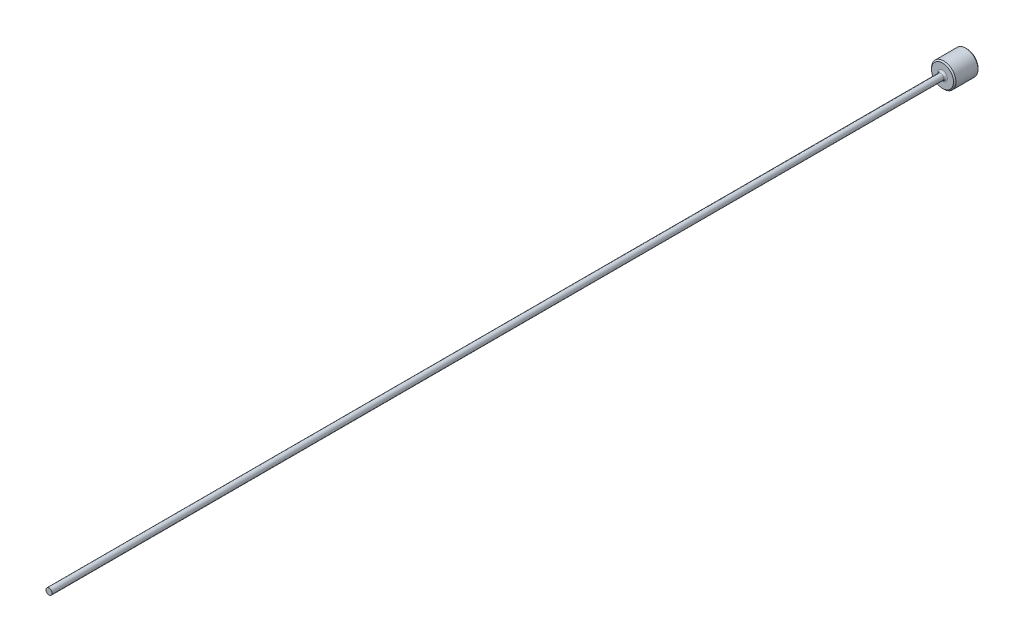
from build123d import *

# Parameters (mm, degrees)
CHAMFER1_SIZE = 0.2


with BuildPart() as part:
    # Sketch1 → Revolve1 (revolve)
    with BuildSketch(Plane(origin=(0, 0, 0), x_dir=(0, 0, -1), z_dir=(1, 0, 0)), mode=Mode.PRIVATE) as revolve1_sk:
        with BuildLine():
            Line((0, 0), (0, 2))
            Line((0, 2), (-4, 2))
            Line((-4, 2), (-4, 0.8))
            ThreePointArc((-4, 0.8), (-4.087867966, 0.587867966), (-4.3, 0.5))
            Line((-4.3, 0.5), (-150, 0.5))
            Line((-150, 0.5), (-150, 0))
            Line((-150, 0), (0, 0))
        make_face()
    revolve(revolve1_sk.sketch.rotate(Axis((0, 0, 109.05062828), (0, 0, -1)), 90), axis=Axis((0, 0, 109.05062828), (0, 0, -1)))

    # Chamfer1
    chamfer1_edges = [part.edges().sort_by_distance(p)[0] for p in [
        (-2, 0, 0),
        (-2, 0, 4),
    ]]
    chamfer(chamfer1_edges, length=CHAMFER1_SIZE)


solid = part.part
